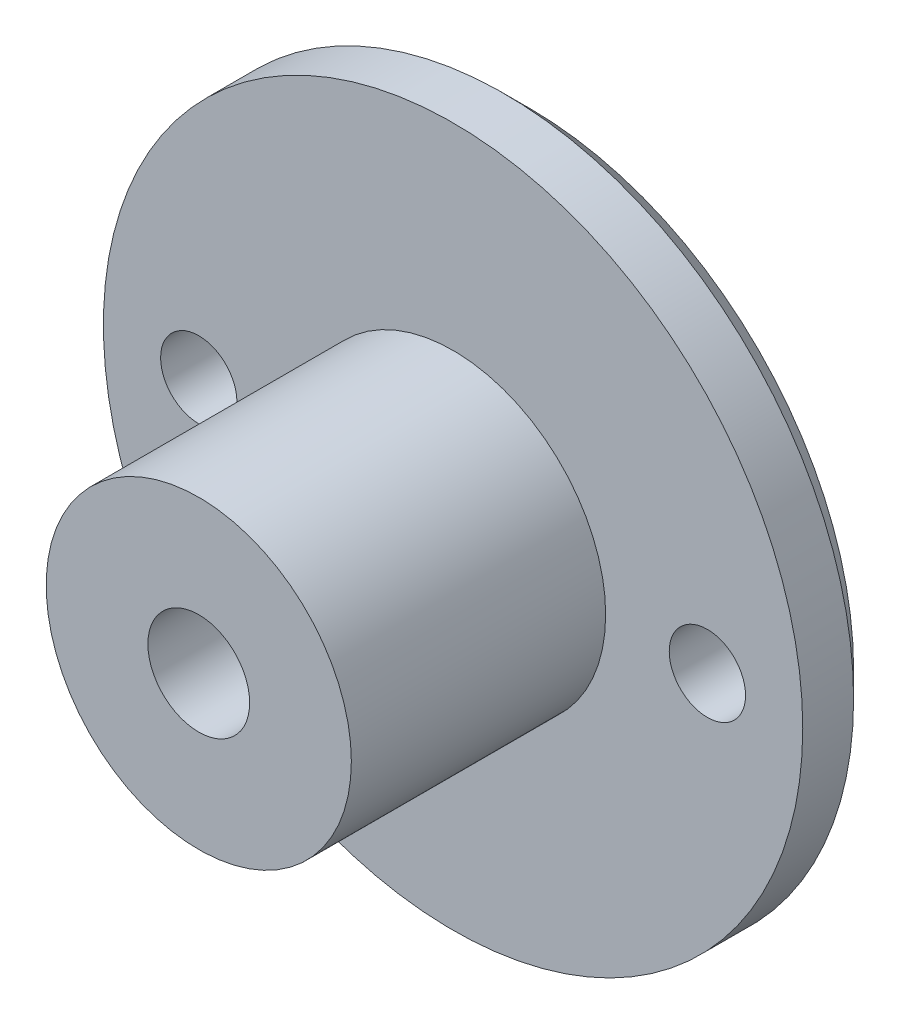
from build123d import *

# Parameters (mm, degrees)
ESQUISSE1_R                       = 13.75
BOSS_EXTRU_1_DEPTH                = 3
ESQUISSE2_R                       = 6
BOSS_EXTRU_2_DEPTH                = 10
CHANFREIN1_SIZE                   = 1
DIAM_TRE_DU_PER_AGE_0_15_0_15_1_D = 4
DIAM_TRE_DU_PER_AGE_0_15_0_15_2_D = 3
R_P_TITION_CIRCULAIRE1_COUNT      = 2


with BuildPart() as part:
    # Esquisse1 → Boss.-Extru.1 (new body)
    with BuildSketch(Plane.XY):
        Circle(ESQUISSE1_R)
    extrude(amount=BOSS_EXTRU_1_DEPTH)

    # Esquisse2 → Boss.-Extru.2 (add)
    with BuildSketch(Plane.XY.offset(3)):
        Circle(ESQUISSE2_R)
    extrude(amount=BOSS_EXTRU_2_DEPTH)

    # Chanfrein1
    chanfrein1_edges = [part.edges().sort_by_distance(p)[0] for p in [
        (-13.75, 0, 0),
    ]]
    chamfer(chanfrein1_edges, length=CHANFREIN1_SIZE)

    # Diam_tre du per_age _0.15 _0.15_1 (through all)
    with Locations(Plane(origin=(0, 0, 0), x_dir=(-1, 0, 0), z_dir=(0, 0, -1))):
        with Locations((0, 0)):
            Hole(DIAM_TRE_DU_PER_AGE_0_15_0_15_1_D / 2)

    # Diam_tre du per_age _0.15 _0.15_2 (through all)
    with Locations(Plane(origin=(0, 0, 0), x_dir=(-1, 0, 0), z_dir=(0, 0, -1))):
        with Locations((-10, 0)):
            diam_tre_du_per_age_0_15_0_15_2 = Hole(DIAM_TRE_DU_PER_AGE_0_15_0_15_2_D / 2)

    # R_p_tition circulaire1: Diam_tre du per_age _0.15 _0.15_2 ×2 about axis
    r_p_tition_circulaire1_axis = Axis((0, 0, 0), (0, 0, 1))
    for i in range(1, R_P_TITION_CIRCULAIRE1_COUNT):
        add(diam_tre_du_per_age_0_15_0_15_2.rotate(r_p_tition_circulaire1_axis, i * 360 / R_P_TITION_CIRCULAIRE1_COUNT), mode=Mode.SUBTRACT)


solid = part.part
